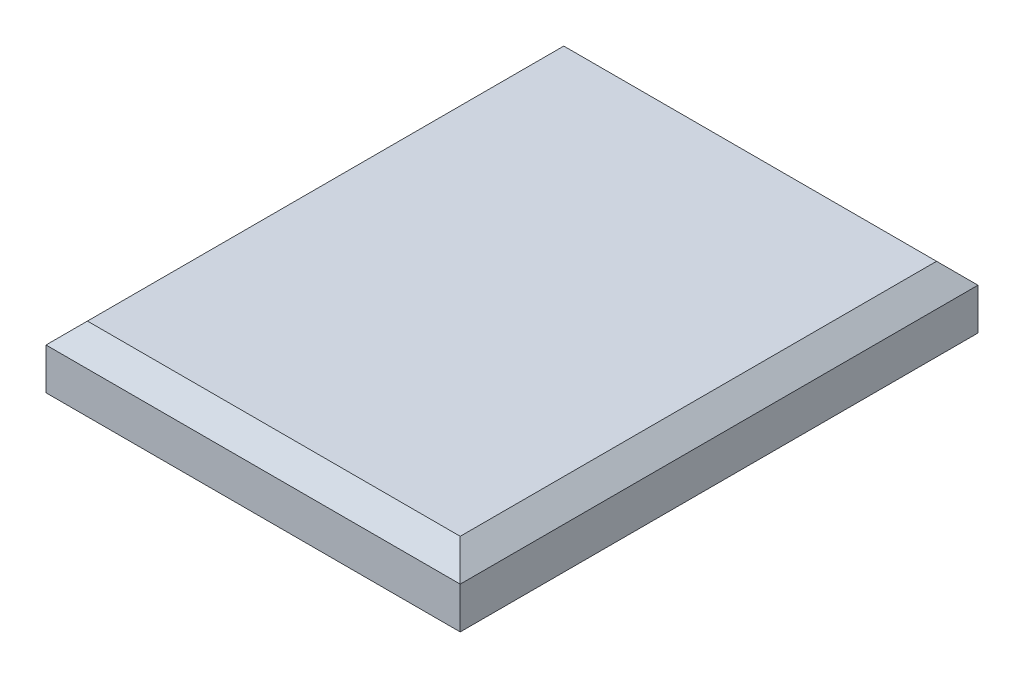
ISO-10303-21;
HEADER;
FILE_DESCRIPTION(('STEP AP214'),'2;1');
FILE_NAME('part.step','',(''),(''),'','','');
FILE_SCHEMA(('AUTOMOTIVE_DESIGN { 1 0 10303 214 1 1 1 1 }'));
ENDSEC;
DATA;
#1=APPLICATION_CONTEXT('core data for automotive mechanical design processes');
#2=APPLICATION_PROTOCOL_DEFINITION('international standard','automotive_design',2000,#1);
#3=PRODUCT_CONTEXT('',#1,'mechanical');
#4=PRODUCT('Part','Part','',(#3));
#5=PRODUCT_RELATED_PRODUCT_CATEGORY('part','',(#4));
#6=PRODUCT_DEFINITION_FORMATION('','',#4);
#7=PRODUCT_DEFINITION_CONTEXT('part definition',#1,'design');
#8=PRODUCT_DEFINITION('design','',#6,#7);
#9=PRODUCT_DEFINITION_SHAPE('','',#8);
#10=(LENGTH_UNIT() NAMED_UNIT(*) SI_UNIT(.MILLI.,.METRE.));
#11=(NAMED_UNIT(*) PLANE_ANGLE_UNIT() SI_UNIT($,.RADIAN.));
#12=(NAMED_UNIT(*) SI_UNIT($,.STERADIAN.) SOLID_ANGLE_UNIT());
#13=UNCERTAINTY_MEASURE_WITH_UNIT(LENGTH_MEASURE(1.E-05),#10,'distance_accuracy_value','');
#14=(GEOMETRIC_REPRESENTATION_CONTEXT(3) GLOBAL_UNCERTAINTY_ASSIGNED_CONTEXT((#13)) GLOBAL_UNIT_ASSIGNED_CONTEXT((#10,
#11,#12)) REPRESENTATION_CONTEXT('',''));
#15=CARTESIAN_POINT('',(0.,0.,0.));
#16=DIRECTION('',(0.,0.,1.));
#17=DIRECTION('',(1.,0.,0.));
#18=AXIS2_PLACEMENT_3D('',#15,#16,#17);
#19=CARTESIAN_POINT('',(0.,0.3,0.));
#20=DIRECTION('',(0.,1.,0.));
#21=DIRECTION('',(0.,0.,1.));
#22=AXIS2_PLACEMENT_3D('',#19,#20,#21);
#23=PLANE('',#22);
#24=DIRECTION('',(0.,0.,1.));
#25=VECTOR('',#24,1.);
#26=CARTESIAN_POINT('',(0.9,0.3,0.625));
#27=LINE('',#26,#25);
#28=CARTESIAN_POINT('',(0.9,0.3,-1.15));
#29=VERTEX_POINT('',#28);
#30=CARTESIAN_POINT('',(0.9,0.3,1.15));
#31=VERTEX_POINT('',#30);
#32=EDGE_CURVE('E90',#29,#31,#27,.T.);
#33=ORIENTED_EDGE('',*,*,#32,.F.);
#34=DIRECTION('',(1.,0.,0.));
#35=VECTOR('',#34,1.);
#36=CARTESIAN_POINT('',(0.5,0.3,-1.15));
#37=LINE('',#36,#35);
#38=CARTESIAN_POINT('',(-0.9,0.3,-1.15));
#39=VERTEX_POINT('',#38);
#40=EDGE_CURVE('E80',#39,#29,#37,.T.);
#41=ORIENTED_EDGE('',*,*,#40,.F.);
#42=DIRECTION('',(0.,0.,1.));
#43=VECTOR('',#42,1.);
#44=CARTESIAN_POINT('',(-0.9,0.3,-0.625));
#45=LINE('',#44,#43);
#46=CARTESIAN_POINT('',(-0.9,0.3,1.15));
#47=VERTEX_POINT('',#46);
#48=EDGE_CURVE('E98',#47,#39,#45,.F.);
#49=ORIENTED_EDGE('',*,*,#48,.F.);
#50=DIRECTION('',(1.,0.,0.));
#51=VECTOR('',#50,1.);
#52=CARTESIAN_POINT('',(-0.5,0.3,1.15));
#53=LINE('',#52,#51);
#54=EDGE_CURVE('E93',#31,#47,#53,.F.);
#55=ORIENTED_EDGE('',*,*,#54,.F.);
#56=EDGE_LOOP('',(#33,#41,#49,#55));
#57=FACE_BOUND('',#56,.T.);
#58=ADVANCED_FACE('F15',(#57),#23,.T.);
#59=CARTESIAN_POINT('',(0.95,0.25,0.625));
#60=DIRECTION('',(0.707106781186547,0.707106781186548,0.));
#61=DIRECTION('',(-0.707106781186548,0.707106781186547,0.));
#62=AXIS2_PLACEMENT_3D('',#59,#60,#61);
#63=PLANE('',#62);
#64=DIRECTION('',(0.,0.,-1.));
#65=VECTOR('',#64,1.);
#66=CARTESIAN_POINT('',(1.,0.2,1.25));
#67=LINE('',#66,#65);
#68=CARTESIAN_POINT('',(1.,0.2,-1.25));
#69=VERTEX_POINT('',#68);
#70=CARTESIAN_POINT('',(1.,0.2,1.25));
#71=VERTEX_POINT('',#70);
#72=EDGE_CURVE('E59',#69,#71,#67,.F.);
#73=ORIENTED_EDGE('',*,*,#72,.F.);
#74=DIRECTION('',(0.577350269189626,-0.577350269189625,-0.577350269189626));
#75=VECTOR('',#74,1.);
#76=CARTESIAN_POINT('',(0.9,0.3,-1.15));
#77=LINE('',#76,#75);
#78=EDGE_CURVE('E85',#29,#69,#77,.T.);
#79=ORIENTED_EDGE('',*,*,#78,.F.);
#80=ORIENTED_EDGE('',*,*,#32,.T.);
#81=DIRECTION('',(-0.577350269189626,0.577350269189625,-0.577350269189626));
#82=VECTOR('',#81,1.);
#83=CARTESIAN_POINT('',(1.,0.2,1.25));
#84=LINE('',#83,#82);
#85=EDGE_CURVE('E102',#71,#31,#84,.T.);
#86=ORIENTED_EDGE('',*,*,#85,.F.);
#87=EDGE_LOOP('',(#73,#79,#80,#86));
#88=FACE_BOUND('',#87,.T.);
#89=ADVANCED_FACE('F97',(#88),#63,.T.);
#90=CARTESIAN_POINT('',(0.5,0.25,-1.2));
#91=DIRECTION('',(0.,0.707106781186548,-0.707106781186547));
#92=DIRECTION('',(0.,0.707106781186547,0.707106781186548));
#93=AXIS2_PLACEMENT_3D('',#90,#91,#92);
#94=PLANE('',#93);
#95=DIRECTION('',(-1.,0.,0.));
#96=VECTOR('',#95,1.);
#97=CARTESIAN_POINT('',(1.,0.2,-1.25));
#98=LINE('',#97,#96);
#99=CARTESIAN_POINT('',(-1.,0.2,-1.25));
#100=VERTEX_POINT('',#99);
#101=EDGE_CURVE('E108',#100,#69,#98,.F.);
#102=ORIENTED_EDGE('',*,*,#101,.F.);
#103=DIRECTION('',(-0.577350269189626,-0.577350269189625,-0.577350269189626));
#104=VECTOR('',#103,1.);
#105=CARTESIAN_POINT('',(-0.9,0.3,-1.15));
#106=LINE('',#105,#104);
#107=EDGE_CURVE('E87',#39,#100,#106,.T.);
#108=ORIENTED_EDGE('',*,*,#107,.F.);
#109=ORIENTED_EDGE('',*,*,#40,.T.);
#110=ORIENTED_EDGE('',*,*,#78,.T.);
#111=EDGE_LOOP('',(#102,#108,#109,#110));
#112=FACE_BOUND('',#111,.T.);
#113=ADVANCED_FACE('F83',(#112),#94,.T.);
#114=CARTESIAN_POINT('',(-0.95,0.25,-0.625));
#115=DIRECTION('',(-0.707106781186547,0.707106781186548,0.));
#116=DIRECTION('',(-0.707106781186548,-0.707106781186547,0.));
#117=AXIS2_PLACEMENT_3D('',#114,#115,#116);
#118=PLANE('',#117);
#119=DIRECTION('',(0.,0.,1.));
#120=VECTOR('',#119,1.);
#121=CARTESIAN_POINT('',(-1.,0.2,-1.25));
#122=LINE('',#121,#120);
#123=CARTESIAN_POINT('',(-1.,0.2,1.25));
#124=VERTEX_POINT('',#123);
#125=EDGE_CURVE('E111',#124,#100,#122,.F.);
#126=ORIENTED_EDGE('',*,*,#125,.F.);
#127=DIRECTION('',(-0.577350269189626,-0.577350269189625,0.577350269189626));
#128=VECTOR('',#127,1.);
#129=CARTESIAN_POINT('',(-0.9,0.3,1.15));
#130=LINE('',#129,#128);
#131=EDGE_CURVE('E53',#47,#124,#130,.T.);
#132=ORIENTED_EDGE('',*,*,#131,.F.);
#133=ORIENTED_EDGE('',*,*,#48,.T.);
#134=ORIENTED_EDGE('',*,*,#107,.T.);
#135=EDGE_LOOP('',(#126,#132,#133,#134));
#136=FACE_BOUND('',#135,.T.);
#137=ADVANCED_FACE('F173',(#136),#118,.T.);
#138=CARTESIAN_POINT('',(-0.5,0.25,1.2));
#139=DIRECTION('',(0.,0.707106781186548,0.707106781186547));
#140=DIRECTION('',(0.,-0.707106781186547,0.707106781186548));
#141=AXIS2_PLACEMENT_3D('',#138,#139,#140);
#142=PLANE('',#141);
#143=ORIENTED_EDGE('',*,*,#54,.T.);
#144=ORIENTED_EDGE('',*,*,#131,.T.);
#145=DIRECTION('',(1.,0.,0.));
#146=VECTOR('',#145,1.);
#147=CARTESIAN_POINT('',(-1.,0.2,1.25));
#148=LINE('',#147,#146);
#149=EDGE_CURVE('E115',#71,#124,#148,.F.);
#150=ORIENTED_EDGE('',*,*,#149,.F.);
#151=ORIENTED_EDGE('',*,*,#85,.T.);
#152=EDGE_LOOP('',(#143,#144,#150,#151));
#153=FACE_BOUND('',#152,.T.);
#154=ADVANCED_FACE('F143',(#153),#142,.T.);
#155=CARTESIAN_POINT('',(1.,0.,1.25));
#156=DIRECTION('',(1.,0.,0.));
#157=DIRECTION('',(0.,0.,-1.));
#158=AXIS2_PLACEMENT_3D('',#155,#156,#157);
#159=PLANE('',#158);
#160=DIRECTION('',(0.,0.,1.));
#161=VECTOR('',#160,1.);
#162=CARTESIAN_POINT('',(1.,0.,0.));
#163=LINE('',#162,#161);
#164=CARTESIAN_POINT('',(1.,0.,1.25));
#165=VERTEX_POINT('',#164);
#166=CARTESIAN_POINT('',(1.,0.,-1.25));
#167=VERTEX_POINT('',#166);
#168=EDGE_CURVE('E19',#165,#167,#163,.F.);
#169=ORIENTED_EDGE('',*,*,#168,.T.);
#170=DIRECTION('',(0.,1.,0.));
#171=VECTOR('',#170,1.);
#172=CARTESIAN_POINT('',(1.,0.,-1.25));
#173=LINE('',#172,#171);
#174=EDGE_CURVE('E109',#69,#167,#173,.F.);
#175=ORIENTED_EDGE('',*,*,#174,.F.);
#176=ORIENTED_EDGE('',*,*,#72,.T.);
#177=DIRECTION('',(0.,1.,0.));
#178=VECTOR('',#177,1.);
#179=CARTESIAN_POINT('',(1.,0.,1.25));
#180=LINE('',#179,#178);
#181=EDGE_CURVE('E118',#165,#71,#180,.T.);
#182=ORIENTED_EDGE('',*,*,#181,.F.);
#183=EDGE_LOOP('',(#169,#175,#176,#182));
#184=FACE_BOUND('',#183,.T.);
#185=ADVANCED_FACE('F128',(#184),#159,.T.);
#186=CARTESIAN_POINT('',(1.,0.,-1.25));
#187=DIRECTION('',(0.,0.,-1.));
#188=DIRECTION('',(-1.,0.,0.));
#189=AXIS2_PLACEMENT_3D('',#186,#187,#188);
#190=PLANE('',#189);
#191=DIRECTION('',(1.,0.,0.));
#192=VECTOR('',#191,1.);
#193=CARTESIAN_POINT('',(0.,0.,-1.25));
#194=LINE('',#193,#192);
#195=CARTESIAN_POINT('',(-1.,0.,-1.25));
#196=VERTEX_POINT('',#195);
#197=EDGE_CURVE('E124',#167,#196,#194,.F.);
#198=ORIENTED_EDGE('',*,*,#197,.T.);
#199=DIRECTION('',(0.,1.,0.));
#200=VECTOR('',#199,1.);
#201=CARTESIAN_POINT('',(-1.,0.,-1.25));
#202=LINE('',#201,#200);
#203=EDGE_CURVE('E113',#100,#196,#202,.F.);
#204=ORIENTED_EDGE('',*,*,#203,.F.);
#205=ORIENTED_EDGE('',*,*,#101,.T.);
#206=ORIENTED_EDGE('',*,*,#174,.T.);
#207=EDGE_LOOP('',(#198,#204,#205,#206));
#208=FACE_BOUND('',#207,.T.);
#209=ADVANCED_FACE('F134',(#208),#190,.T.);
#210=CARTESIAN_POINT('',(-1.,0.,-1.25));
#211=DIRECTION('',(-1.,0.,0.));
#212=DIRECTION('',(0.,0.,1.));
#213=AXIS2_PLACEMENT_3D('',#210,#211,#212);
#214=PLANE('',#213);
#215=DIRECTION('',(0.,0.,1.));
#216=VECTOR('',#215,1.);
#217=CARTESIAN_POINT('',(-1.,0.,0.));
#218=LINE('',#217,#216);
#219=CARTESIAN_POINT('',(-1.,0.,1.25));
#220=VERTEX_POINT('',#219);
#221=EDGE_CURVE('E25',#196,#220,#218,.T.);
#222=ORIENTED_EDGE('',*,*,#221,.T.);
#223=DIRECTION('',(0.,1.,0.));
#224=VECTOR('',#223,1.);
#225=CARTESIAN_POINT('',(-1.,0.,1.25));
#226=LINE('',#225,#224);
#227=EDGE_CURVE('E33',#124,#220,#226,.F.);
#228=ORIENTED_EDGE('',*,*,#227,.F.);
#229=ORIENTED_EDGE('',*,*,#125,.T.);
#230=ORIENTED_EDGE('',*,*,#203,.T.);
#231=EDGE_LOOP('',(#222,#228,#229,#230));
#232=FACE_BOUND('',#231,.T.);
#233=ADVANCED_FACE('F132',(#232),#214,.T.);
#234=CARTESIAN_POINT('',(-1.,0.,1.25));
#235=DIRECTION('',(0.,0.,1.));
#236=DIRECTION('',(1.,0.,0.));
#237=AXIS2_PLACEMENT_3D('',#234,#235,#236);
#238=PLANE('',#237);
#239=DIRECTION('',(1.,0.,0.));
#240=VECTOR('',#239,1.);
#241=CARTESIAN_POINT('',(0.,0.,1.25));
#242=LINE('',#241,#240);
#243=EDGE_CURVE('E10',#220,#165,#242,.T.);
#244=ORIENTED_EDGE('',*,*,#243,.T.);
#245=ORIENTED_EDGE('',*,*,#181,.T.);
#246=ORIENTED_EDGE('',*,*,#149,.T.);
#247=ORIENTED_EDGE('',*,*,#227,.T.);
#248=EDGE_LOOP('',(#244,#245,#246,#247));
#249=FACE_BOUND('',#248,.T.);
#250=ADVANCED_FACE('F129',(#249),#238,.T.);
#251=CARTESIAN_POINT('',(0.,0.,0.));
#252=DIRECTION('',(0.,1.,0.));
#253=DIRECTION('',(0.,0.,1.));
#254=AXIS2_PLACEMENT_3D('',#251,#252,#253);
#255=PLANE('',#254);
#256=ORIENTED_EDGE('',*,*,#221,.F.);
#257=ORIENTED_EDGE('',*,*,#197,.F.);
#258=ORIENTED_EDGE('',*,*,#168,.F.);
#259=ORIENTED_EDGE('',*,*,#243,.F.);
#260=EDGE_LOOP('',(#256,#257,#258,#259));
#261=FACE_BOUND('',#260,.T.);
#262=ADVANCED_FACE('F17',(#261),#255,.F.);
#263=CLOSED_SHELL('',(#58,#89,#113,#137,#154,#185,#209,#233,#250,#262));
#264=MANIFOLD_SOLID_BREP('B1',#263);
#265=ADVANCED_BREP_SHAPE_REPRESENTATION('',(#18,#264),#14);
#266=SHAPE_DEFINITION_REPRESENTATION(#9,#265);
ENDSEC;
END-ISO-10303-21;
